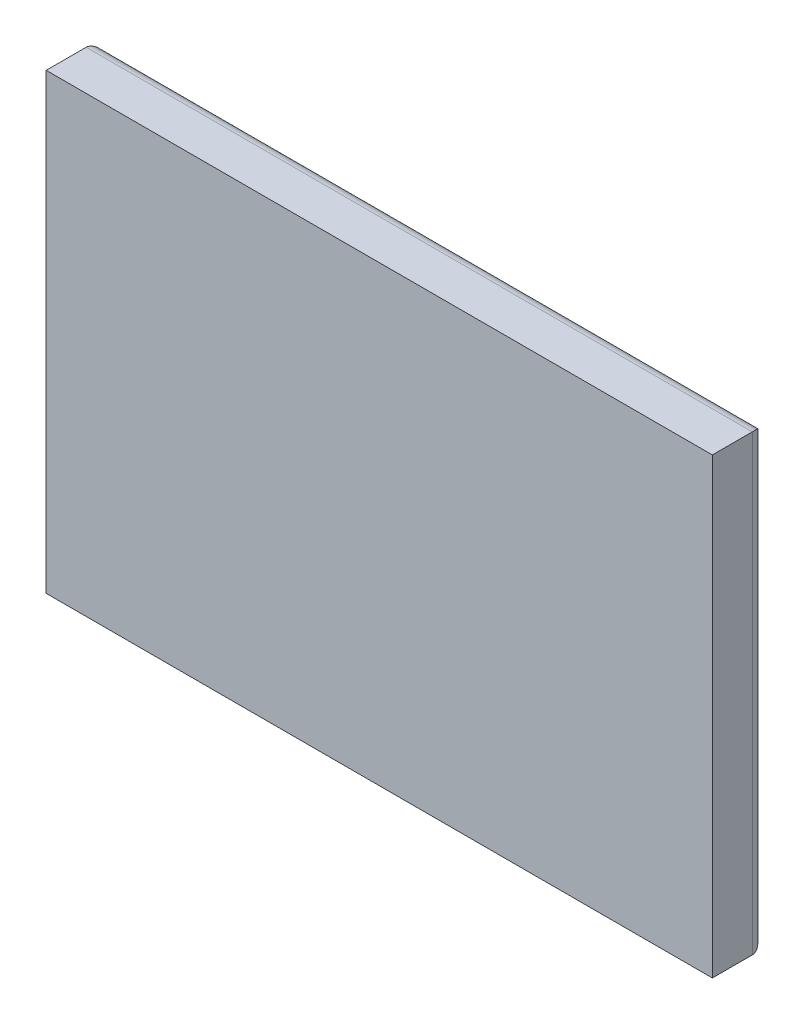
ISO-10303-21;
HEADER;
FILE_DESCRIPTION(('STEP AP214'),'2;1');
FILE_NAME('part.step','',(''),(''),'','','');
FILE_SCHEMA(('AUTOMOTIVE_DESIGN { 1 0 10303 214 1 1 1 1 }'));
ENDSEC;
DATA;
#1=APPLICATION_CONTEXT('core data for automotive mechanical design processes');
#2=APPLICATION_PROTOCOL_DEFINITION('international standard','automotive_design',2000,#1);
#3=PRODUCT_CONTEXT('',#1,'mechanical');
#4=PRODUCT('Part','Part','',(#3));
#5=PRODUCT_RELATED_PRODUCT_CATEGORY('part','',(#4));
#6=PRODUCT_DEFINITION_FORMATION('','',#4);
#7=PRODUCT_DEFINITION_CONTEXT('part definition',#1,'design');
#8=PRODUCT_DEFINITION('design','',#6,#7);
#9=PRODUCT_DEFINITION_SHAPE('','',#8);
#10=(LENGTH_UNIT() NAMED_UNIT(*) SI_UNIT(.MILLI.,.METRE.));
#11=(NAMED_UNIT(*) PLANE_ANGLE_UNIT() SI_UNIT($,.RADIAN.));
#12=(NAMED_UNIT(*) SI_UNIT($,.STERADIAN.) SOLID_ANGLE_UNIT());
#13=UNCERTAINTY_MEASURE_WITH_UNIT(LENGTH_MEASURE(1.E-05),#10,'distance_accuracy_value','');
#14=(GEOMETRIC_REPRESENTATION_CONTEXT(3) GLOBAL_UNCERTAINTY_ASSIGNED_CONTEXT((#13)) GLOBAL_UNIT_ASSIGNED_CONTEXT((#10,
#11,#12)) REPRESENTATION_CONTEXT('',''));
#15=CARTESIAN_POINT('',(0.,0.,0.));
#16=DIRECTION('',(0.,0.,1.));
#17=DIRECTION('',(1.,0.,0.));
#18=AXIS2_PLACEMENT_3D('',#15,#16,#17);
#19=CARTESIAN_POINT('',(15.875,-10.795,2.54));
#20=DIRECTION('',(-1.,0.,0.));
#21=DIRECTION('',(0.,0.,1.));
#22=AXIS2_PLACEMENT_3D('',#19,#20,#21);
#23=PLANE('',#22);
#24=DIRECTION('',(0.,0.,-1.));
#25=VECTOR('',#24,1.);
#26=CARTESIAN_POINT('',(15.875,-10.795,2.54));
#27=LINE('',#26,#25);
#28=CARTESIAN_POINT('',(15.875,-10.795,2.54));
#29=VERTEX_POINT('',#28);
#30=CARTESIAN_POINT('',(15.875,-10.795,0.635));
#31=VERTEX_POINT('',#30);
#32=EDGE_CURVE('E182',#29,#31,#27,.T.);
#33=ORIENTED_EDGE('',*,*,#32,.T.);
#34=DIRECTION('',(0.,1.,0.));
#35=VECTOR('',#34,1.);
#36=CARTESIAN_POINT('',(15.875,10.795,0.635));
#37=LINE('',#36,#35);
#38=CARTESIAN_POINT('',(15.875,10.795,0.635));
#39=VERTEX_POINT('',#38);
#40=EDGE_CURVE('E11',#31,#39,#37,.T.);
#41=ORIENTED_EDGE('',*,*,#40,.T.);
#42=DIRECTION('',(0.,0.,-1.));
#43=VECTOR('',#42,1.);
#44=CARTESIAN_POINT('',(15.875,10.795,2.54));
#45=LINE('',#44,#43);
#46=CARTESIAN_POINT('',(15.875,10.795,2.54));
#47=VERTEX_POINT('',#46);
#48=EDGE_CURVE('E193',#47,#39,#45,.T.);
#49=ORIENTED_EDGE('',*,*,#48,.F.);
#50=DIRECTION('',(0.,1.,0.));
#51=VECTOR('',#50,1.);
#52=CARTESIAN_POINT('',(15.875,-10.795,2.54));
#53=LINE('',#52,#51);
#54=EDGE_CURVE('E169',#29,#47,#53,.T.);
#55=ORIENTED_EDGE('',*,*,#54,.F.);
#56=EDGE_LOOP('',(#33,#41,#49,#55));
#57=FACE_BOUND('',#56,.T.);
#58=ADVANCED_FACE('F38',(#57),#23,.F.);
#59=CARTESIAN_POINT('',(-15.875,10.795,2.54));
#60=DIRECTION('',(0.,-1.,0.));
#61=DIRECTION('',(0.,0.,-1.));
#62=AXIS2_PLACEMENT_3D('',#59,#60,#61);
#63=PLANE('',#62);
#64=ORIENTED_EDGE('',*,*,#48,.T.);
#65=DIRECTION('',(-1.,0.,0.));
#66=VECTOR('',#65,1.);
#67=CARTESIAN_POINT('',(-15.875,10.795,0.635));
#68=LINE('',#67,#66);
#69=CARTESIAN_POINT('',(-15.875,10.795,0.635));
#70=VERTEX_POINT('',#69);
#71=EDGE_CURVE('E48',#39,#70,#68,.T.);
#72=ORIENTED_EDGE('',*,*,#71,.T.);
#73=DIRECTION('',(0.,0.,-1.));
#74=VECTOR('',#73,1.);
#75=CARTESIAN_POINT('',(-15.875,10.795,2.54));
#76=LINE('',#75,#74);
#77=CARTESIAN_POINT('',(-15.875,10.795,2.54));
#78=VERTEX_POINT('',#77);
#79=EDGE_CURVE('E189',#78,#70,#76,.T.);
#80=ORIENTED_EDGE('',*,*,#79,.F.);
#81=DIRECTION('',(-1.,0.,0.));
#82=VECTOR('',#81,1.);
#83=CARTESIAN_POINT('',(-15.875,10.795,2.54));
#84=LINE('',#83,#82);
#85=EDGE_CURVE('E173',#47,#78,#84,.T.);
#86=ORIENTED_EDGE('',*,*,#85,.F.);
#87=EDGE_LOOP('',(#64,#72,#80,#86));
#88=FACE_BOUND('',#87,.T.);
#89=ADVANCED_FACE('F260',(#88),#63,.F.);
#90=CARTESIAN_POINT('',(-15.875,-10.795,2.54));
#91=DIRECTION('',(1.,0.,0.));
#92=DIRECTION('',(0.,0.,-1.));
#93=AXIS2_PLACEMENT_3D('',#90,#91,#92);
#94=PLANE('',#93);
#95=ORIENTED_EDGE('',*,*,#79,.T.);
#96=DIRECTION('',(0.,-1.,0.));
#97=VECTOR('',#96,1.);
#98=CARTESIAN_POINT('',(-15.875,-10.795,0.635));
#99=LINE('',#98,#97);
#100=CARTESIAN_POINT('',(-15.875,-10.795,0.635));
#101=VERTEX_POINT('',#100);
#102=EDGE_CURVE('E196',#70,#101,#99,.T.);
#103=ORIENTED_EDGE('',*,*,#102,.T.);
#104=DIRECTION('',(0.,0.,-1.));
#105=VECTOR('',#104,1.);
#106=CARTESIAN_POINT('',(-15.875,-10.795,2.54));
#107=LINE('',#106,#105);
#108=CARTESIAN_POINT('',(-15.875,-10.795,2.54));
#109=VERTEX_POINT('',#108);
#110=EDGE_CURVE('E185',#109,#101,#107,.T.);
#111=ORIENTED_EDGE('',*,*,#110,.F.);
#112=DIRECTION('',(0.,-1.,0.));
#113=VECTOR('',#112,1.);
#114=CARTESIAN_POINT('',(-15.875,-10.795,2.54));
#115=LINE('',#114,#113);
#116=EDGE_CURVE('E176',#78,#109,#115,.T.);
#117=ORIENTED_EDGE('',*,*,#116,.F.);
#118=EDGE_LOOP('',(#95,#103,#111,#117));
#119=FACE_BOUND('',#118,.T.);
#120=ADVANCED_FACE('F251',(#119),#94,.F.);
#121=CARTESIAN_POINT('',(-15.875,-10.795,2.54));
#122=DIRECTION('',(0.,1.,0.));
#123=DIRECTION('',(0.,0.,1.));
#124=AXIS2_PLACEMENT_3D('',#121,#122,#123);
#125=PLANE('',#124);
#126=ORIENTED_EDGE('',*,*,#110,.T.);
#127=DIRECTION('',(1.,0.,0.));
#128=VECTOR('',#127,1.);
#129=CARTESIAN_POINT('',(15.875,-10.795,0.635));
#130=LINE('',#129,#128);
#131=EDGE_CURVE('E213',#101,#31,#130,.T.);
#132=ORIENTED_EDGE('',*,*,#131,.T.);
#133=ORIENTED_EDGE('',*,*,#32,.F.);
#134=DIRECTION('',(1.,0.,0.));
#135=VECTOR('',#134,1.);
#136=CARTESIAN_POINT('',(-15.875,-10.795,2.54));
#137=LINE('',#136,#135);
#138=EDGE_CURVE('E179',#109,#29,#137,.T.);
#139=ORIENTED_EDGE('',*,*,#138,.F.);
#140=EDGE_LOOP('',(#126,#132,#133,#139));
#141=FACE_BOUND('',#140,.T.);
#142=ADVANCED_FACE('F255',(#141),#125,.F.);
#143=CARTESIAN_POINT('',(0.,0.,2.54));
#144=DIRECTION('',(0.,0.,-1.));
#145=DIRECTION('',(-1.,0.,0.));
#146=AXIS2_PLACEMENT_3D('',#143,#144,#145);
#147=PLANE('',#146);
#148=ORIENTED_EDGE('',*,*,#54,.T.);
#149=ORIENTED_EDGE('',*,*,#85,.T.);
#150=ORIENTED_EDGE('',*,*,#116,.T.);
#151=ORIENTED_EDGE('',*,*,#138,.T.);
#152=EDGE_LOOP('',(#148,#149,#150,#151));
#153=FACE_BOUND('',#152,.T.);
#154=ADVANCED_FACE('F258',(#153),#147,.F.);
#155=CARTESIAN_POINT('',(0.,0.,0.));
#156=DIRECTION('',(0.,0.,-1.));
#157=DIRECTION('',(-1.,0.,0.));
#158=AXIS2_PLACEMENT_3D('',#155,#156,#157);
#159=PLANE('',#158);
#160=DIRECTION('',(0.,1.,0.));
#161=VECTOR('',#160,1.);
#162=CARTESIAN_POINT('',(-14.605,-9.525,0.));
#163=LINE('',#162,#161);
#164=CARTESIAN_POINT('',(-14.605,-9.525,0.));
#165=VERTEX_POINT('',#164);
#166=CARTESIAN_POINT('',(-14.605,9.525,0.));
#167=VERTEX_POINT('',#166);
#168=EDGE_CURVE('E56',#165,#167,#163,.T.);
#169=ORIENTED_EDGE('',*,*,#168,.F.);
#170=DIRECTION('',(-1.,0.,0.));
#171=VECTOR('',#170,1.);
#172=CARTESIAN_POINT('',(14.605,-9.525,0.));
#173=LINE('',#172,#171);
#174=CARTESIAN_POINT('',(14.605,-9.525,0.));
#175=VERTEX_POINT('',#174);
#176=EDGE_CURVE('E141',#175,#165,#173,.T.);
#177=ORIENTED_EDGE('',*,*,#176,.F.);
#178=DIRECTION('',(0.,-1.,0.));
#179=VECTOR('',#178,1.);
#180=CARTESIAN_POINT('',(14.605,-9.525,0.));
#181=LINE('',#180,#179);
#182=CARTESIAN_POINT('',(14.605,9.525,0.));
#183=VERTEX_POINT('',#182);
#184=EDGE_CURVE('E145',#183,#175,#181,.T.);
#185=ORIENTED_EDGE('',*,*,#184,.F.);
#186=DIRECTION('',(1.,0.,0.));
#187=VECTOR('',#186,1.);
#188=CARTESIAN_POINT('',(14.605,9.525,0.));
#189=LINE('',#188,#187);
#190=EDGE_CURVE('E154',#167,#183,#189,.T.);
#191=ORIENTED_EDGE('',*,*,#190,.F.);
#192=EDGE_LOOP('',(#169,#177,#185,#191));
#193=FACE_BOUND('',#192,.T.);
#194=DIRECTION('',(1.,0.,0.));
#195=VECTOR('',#194,1.);
#196=CARTESIAN_POINT('',(-15.875,-10.16,0.));
#197=LINE('',#196,#195);
#198=CARTESIAN_POINT('',(15.24,-10.16,0.));
#199=VERTEX_POINT('',#198);
#200=CARTESIAN_POINT('',(-15.24,-10.16,0.));
#201=VERTEX_POINT('',#200);
#202=EDGE_CURVE('E206',#199,#201,#197,.F.);
#203=ORIENTED_EDGE('',*,*,#202,.T.);
#204=DIRECTION('',(0.,-1.,0.));
#205=VECTOR('',#204,1.);
#206=CARTESIAN_POINT('',(-15.24,10.795,0.));
#207=LINE('',#206,#205);
#208=CARTESIAN_POINT('',(-15.24,10.16,0.));
#209=VERTEX_POINT('',#208);
#210=EDGE_CURVE('E209',#201,#209,#207,.F.);
#211=ORIENTED_EDGE('',*,*,#210,.T.);
#212=DIRECTION('',(-1.,0.,0.));
#213=VECTOR('',#212,1.);
#214=CARTESIAN_POINT('',(15.875,10.16,0.));
#215=LINE('',#214,#213);
#216=CARTESIAN_POINT('',(15.24,10.16,0.));
#217=VERTEX_POINT('',#216);
#218=EDGE_CURVE('E203',#209,#217,#215,.F.);
#219=ORIENTED_EDGE('',*,*,#218,.T.);
#220=DIRECTION('',(0.,1.,0.));
#221=VECTOR('',#220,1.);
#222=CARTESIAN_POINT('',(15.24,-10.795,0.));
#223=LINE('',#222,#221);
#224=EDGE_CURVE('E200',#217,#199,#223,.F.);
#225=ORIENTED_EDGE('',*,*,#224,.T.);
#226=EDGE_LOOP('',(#203,#211,#219,#225));
#227=FACE_BOUND('',#226,.T.);
#228=ADVANCED_FACE('F240',(#193,#227),#159,.T.);
#229=CARTESIAN_POINT('',(15.24,-10.795,0.635));
#230=DIRECTION('',(0.,-1.,0.));
#231=DIRECTION('',(0.,0.,-1.));
#232=AXIS2_PLACEMENT_3D('',#229,#230,#231);
#233=CYLINDRICAL_SURFACE('',#232,0.635);
#234=CARTESIAN_POINT('',(15.24,-10.16,0.635));
#235=DIRECTION('',(-0.707106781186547,-0.707106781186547,0.));
#236=DIRECTION('',(0.707106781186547,-0.707106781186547,0.));
#237=AXIS2_PLACEMENT_3D('',#234,#235,#236);
#238=ELLIPSE('',#237,0.898025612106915,0.635);
#239=EDGE_CURVE('E222',#199,#31,#238,.T.);
#240=ORIENTED_EDGE('',*,*,#239,.F.);
#241=ORIENTED_EDGE('',*,*,#224,.F.);
#242=CARTESIAN_POINT('',(15.24,10.16,0.635));
#243=DIRECTION('',(0.707106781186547,-0.707106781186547,0.));
#244=DIRECTION('',(-0.707106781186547,-0.707106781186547,0.));
#245=AXIS2_PLACEMENT_3D('',#242,#243,#244);
#246=ELLIPSE('',#245,0.898025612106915,0.635);
#247=EDGE_CURVE('E42',#39,#217,#246,.F.);
#248=ORIENTED_EDGE('',*,*,#247,.F.);
#249=ORIENTED_EDGE('',*,*,#40,.F.);
#250=EDGE_LOOP('',(#240,#241,#248,#249));
#251=FACE_BOUND('',#250,.T.);
#252=ADVANCED_FACE('F40',(#251),#233,.T.);
#253=CARTESIAN_POINT('',(-15.875,10.16,0.635));
#254=DIRECTION('',(1.,0.,0.));
#255=DIRECTION('',(0.,0.,-1.));
#256=AXIS2_PLACEMENT_3D('',#253,#254,#255);
#257=CYLINDRICAL_SURFACE('',#256,0.635);
#258=ORIENTED_EDGE('',*,*,#247,.T.);
#259=ORIENTED_EDGE('',*,*,#218,.F.);
#260=CARTESIAN_POINT('',(-15.24,10.16,0.635));
#261=DIRECTION('',(0.707106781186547,0.707106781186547,0.));
#262=DIRECTION('',(0.707106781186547,-0.707106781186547,0.));
#263=AXIS2_PLACEMENT_3D('',#260,#261,#262);
#264=ELLIPSE('',#263,0.898025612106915,0.635);
#265=EDGE_CURVE('E220',#70,#209,#264,.F.);
#266=ORIENTED_EDGE('',*,*,#265,.F.);
#267=ORIENTED_EDGE('',*,*,#71,.F.);
#268=EDGE_LOOP('',(#258,#259,#266,#267));
#269=FACE_BOUND('',#268,.T.);
#270=ADVANCED_FACE('F235',(#269),#257,.T.);
#271=CARTESIAN_POINT('',(-15.875,-10.16,0.635));
#272=DIRECTION('',(-1.,0.,0.));
#273=DIRECTION('',(0.,0.,1.));
#274=AXIS2_PLACEMENT_3D('',#271,#272,#273);
#275=CYLINDRICAL_SURFACE('',#274,0.635);
#276=ORIENTED_EDGE('',*,*,#239,.T.);
#277=ORIENTED_EDGE('',*,*,#131,.F.);
#278=CARTESIAN_POINT('',(-15.24,-10.16,0.635));
#279=DIRECTION('',(-0.707106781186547,0.707106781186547,0.));
#280=DIRECTION('',(-0.707106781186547,-0.707106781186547,0.));
#281=AXIS2_PLACEMENT_3D('',#278,#279,#280);
#282=ELLIPSE('',#281,0.898025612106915,0.635);
#283=EDGE_CURVE('E163',#201,#101,#282,.T.);
#284=ORIENTED_EDGE('',*,*,#283,.F.);
#285=ORIENTED_EDGE('',*,*,#202,.F.);
#286=EDGE_LOOP('',(#276,#277,#284,#285));
#287=FACE_BOUND('',#286,.T.);
#288=ADVANCED_FACE('F246',(#287),#275,.T.);
#289=CARTESIAN_POINT('',(-15.24,-10.795,0.635));
#290=DIRECTION('',(0.,1.,0.));
#291=DIRECTION('',(0.,0.,1.));
#292=AXIS2_PLACEMENT_3D('',#289,#290,#291);
#293=CYLINDRICAL_SURFACE('',#292,0.635);
#294=ORIENTED_EDGE('',*,*,#265,.T.);
#295=ORIENTED_EDGE('',*,*,#210,.F.);
#296=ORIENTED_EDGE('',*,*,#283,.T.);
#297=ORIENTED_EDGE('',*,*,#102,.F.);
#298=EDGE_LOOP('',(#294,#295,#296,#297));
#299=FACE_BOUND('',#298,.T.);
#300=ADVANCED_FACE('F244',(#299),#293,.T.);
#301=CARTESIAN_POINT('',(-14.605,-9.525,1.905));
#302=DIRECTION('',(-1.,0.,0.));
#303=DIRECTION('',(0.,0.,1.));
#304=AXIS2_PLACEMENT_3D('',#301,#302,#303);
#305=PLANE('',#304);
#306=ORIENTED_EDGE('',*,*,#168,.T.);
#307=DIRECTION('',(0.,0.,-1.));
#308=VECTOR('',#307,1.);
#309=CARTESIAN_POINT('',(-14.605,9.525,1.905));
#310=LINE('',#309,#308);
#311=CARTESIAN_POINT('',(-14.605,9.525,1.905));
#312=VERTEX_POINT('',#311);
#313=EDGE_CURVE('E116',#312,#167,#310,.T.);
#314=ORIENTED_EDGE('',*,*,#313,.F.);
#315=DIRECTION('',(0.,1.,0.));
#316=VECTOR('',#315,1.);
#317=CARTESIAN_POINT('',(-14.605,-9.525,1.905));
#318=LINE('',#317,#316);
#319=CARTESIAN_POINT('',(-14.605,-9.525,1.905));
#320=VERTEX_POINT('',#319);
#321=EDGE_CURVE('E120',#320,#312,#318,.T.);
#322=ORIENTED_EDGE('',*,*,#321,.F.);
#323=DIRECTION('',(0.,0.,-1.));
#324=VECTOR('',#323,1.);
#325=CARTESIAN_POINT('',(-14.605,-9.525,1.905));
#326=LINE('',#325,#324);
#327=EDGE_CURVE('E160',#320,#165,#326,.T.);
#328=ORIENTED_EDGE('',*,*,#327,.T.);
#329=EDGE_LOOP('',(#306,#314,#322,#328));
#330=FACE_BOUND('',#329,.T.);
#331=ADVANCED_FACE('F118',(#330),#305,.F.);
#332=CARTESIAN_POINT('',(14.605,-9.525,1.905));
#333=DIRECTION('',(0.,-1.,0.));
#334=DIRECTION('',(0.,0.,-1.));
#335=AXIS2_PLACEMENT_3D('',#332,#333,#334);
#336=PLANE('',#335);
#337=ORIENTED_EDGE('',*,*,#176,.T.);
#338=ORIENTED_EDGE('',*,*,#327,.F.);
#339=DIRECTION('',(-1.,0.,0.));
#340=VECTOR('',#339,1.);
#341=CARTESIAN_POINT('',(14.605,-9.525,1.905));
#342=LINE('',#341,#340);
#343=CARTESIAN_POINT('',(14.605,-9.525,1.905));
#344=VERTEX_POINT('',#343);
#345=EDGE_CURVE('E127',#344,#320,#342,.T.);
#346=ORIENTED_EDGE('',*,*,#345,.F.);
#347=DIRECTION('',(0.,0.,-1.));
#348=VECTOR('',#347,1.);
#349=CARTESIAN_POINT('',(14.605,-9.525,1.905));
#350=LINE('',#349,#348);
#351=EDGE_CURVE('E164',#344,#175,#350,.T.);
#352=ORIENTED_EDGE('',*,*,#351,.T.);
#353=EDGE_LOOP('',(#337,#338,#346,#352));
#354=FACE_BOUND('',#353,.T.);
#355=ADVANCED_FACE('F333',(#354),#336,.F.);
#356=CARTESIAN_POINT('',(14.605,-9.525,1.905));
#357=DIRECTION('',(1.,0.,0.));
#358=DIRECTION('',(0.,0.,-1.));
#359=AXIS2_PLACEMENT_3D('',#356,#357,#358);
#360=PLANE('',#359);
#361=ORIENTED_EDGE('',*,*,#184,.T.);
#362=ORIENTED_EDGE('',*,*,#351,.F.);
#363=DIRECTION('',(0.,-1.,0.));
#364=VECTOR('',#363,1.);
#365=CARTESIAN_POINT('',(14.605,-9.525,1.905));
#366=LINE('',#365,#364);
#367=CARTESIAN_POINT('',(14.605,9.525,1.905));
#368=VERTEX_POINT('',#367);
#369=EDGE_CURVE('E136',#368,#344,#366,.T.);
#370=ORIENTED_EDGE('',*,*,#369,.F.);
#371=DIRECTION('',(0.,0.,-1.));
#372=VECTOR('',#371,1.);
#373=CARTESIAN_POINT('',(14.605,9.525,1.905));
#374=LINE('',#373,#372);
#375=EDGE_CURVE('E126',#368,#183,#374,.T.);
#376=ORIENTED_EDGE('',*,*,#375,.T.);
#377=EDGE_LOOP('',(#361,#362,#370,#376));
#378=FACE_BOUND('',#377,.T.);
#379=ADVANCED_FACE('F340',(#378),#360,.F.);
#380=CARTESIAN_POINT('',(14.605,9.525,1.905));
#381=DIRECTION('',(0.,1.,0.));
#382=DIRECTION('',(0.,0.,1.));
#383=AXIS2_PLACEMENT_3D('',#380,#381,#382);
#384=PLANE('',#383);
#385=ORIENTED_EDGE('',*,*,#190,.T.);
#386=ORIENTED_EDGE('',*,*,#375,.F.);
#387=DIRECTION('',(1.,0.,0.));
#388=VECTOR('',#387,1.);
#389=CARTESIAN_POINT('',(14.605,9.525,1.905));
#390=LINE('',#389,#388);
#391=EDGE_CURVE('E130',#312,#368,#390,.T.);
#392=ORIENTED_EDGE('',*,*,#391,.F.);
#393=ORIENTED_EDGE('',*,*,#313,.T.);
#394=EDGE_LOOP('',(#385,#386,#392,#393));
#395=FACE_BOUND('',#394,.T.);
#396=ADVANCED_FACE('F131',(#395),#384,.F.);
#397=CARTESIAN_POINT('',(0.,0.,1.905));
#398=DIRECTION('',(0.,0.,1.));
#399=DIRECTION('',(1.,0.,0.));
#400=AXIS2_PLACEMENT_3D('',#397,#398,#399);
#401=PLANE('',#400);
#402=ORIENTED_EDGE('',*,*,#321,.T.);
#403=ORIENTED_EDGE('',*,*,#391,.T.);
#404=ORIENTED_EDGE('',*,*,#369,.T.);
#405=ORIENTED_EDGE('',*,*,#345,.T.);
#406=EDGE_LOOP('',(#402,#403,#404,#405));
#407=FACE_BOUND('',#406,.T.);
#408=ADVANCED_FACE('F138',(#407),#401,.F.);
#409=CLOSED_SHELL('',(#58,#89,#120,#142,#154,#228,#252,#270,#288,#300,#331,#355,#379,#396,#408));
#410=MANIFOLD_SOLID_BREP('B2',#409);
#411=ADVANCED_BREP_SHAPE_REPRESENTATION('',(#18,#410),#14);
#412=SHAPE_DEFINITION_REPRESENTATION(#9,#411);
ENDSEC;
END-ISO-10303-21;
